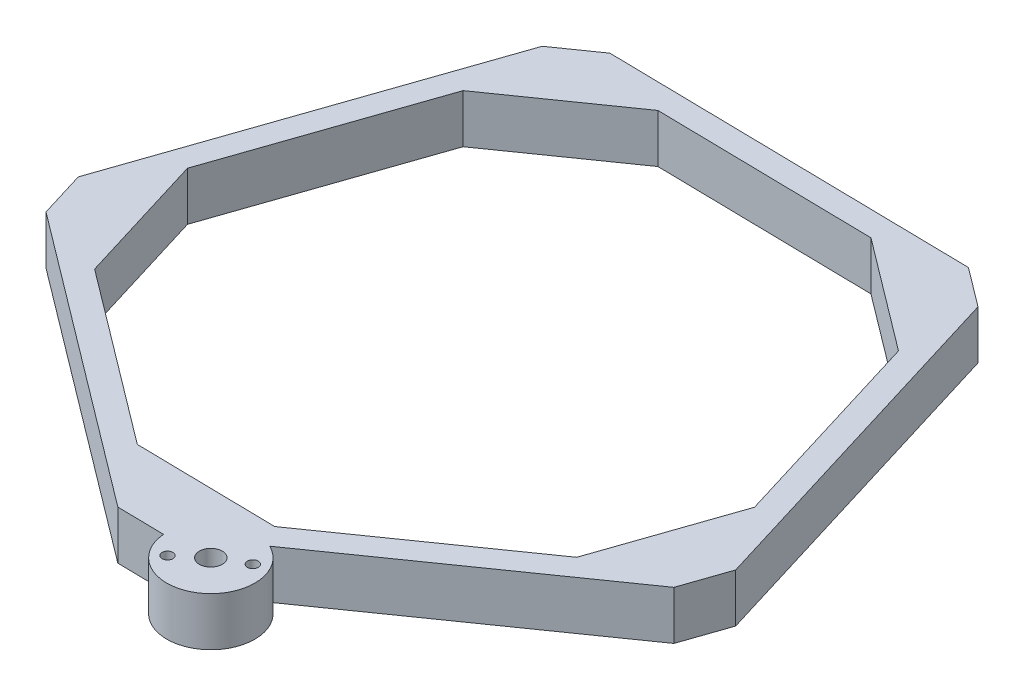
ISO-10303-21;
HEADER;
FILE_DESCRIPTION(('STEP AP214'),'2;1');
FILE_NAME('part.step','',(''),(''),'','','');
FILE_SCHEMA(('AUTOMOTIVE_DESIGN { 1 0 10303 214 1 1 1 1 }'));
ENDSEC;
DATA;
#1=APPLICATION_CONTEXT('core data for automotive mechanical design processes');
#2=APPLICATION_PROTOCOL_DEFINITION('international standard','automotive_design',2000,#1);
#3=PRODUCT_CONTEXT('',#1,'mechanical');
#4=PRODUCT('Part','Part','',(#3));
#5=PRODUCT_RELATED_PRODUCT_CATEGORY('part','',(#4));
#6=PRODUCT_DEFINITION_FORMATION('','',#4);
#7=PRODUCT_DEFINITION_CONTEXT('part definition',#1,'design');
#8=PRODUCT_DEFINITION('design','',#6,#7);
#9=PRODUCT_DEFINITION_SHAPE('','',#8);
#10=(LENGTH_UNIT() NAMED_UNIT(*) SI_UNIT(.MILLI.,.METRE.));
#11=(NAMED_UNIT(*) PLANE_ANGLE_UNIT() SI_UNIT($,.RADIAN.));
#12=(NAMED_UNIT(*) SI_UNIT($,.STERADIAN.) SOLID_ANGLE_UNIT());
#13=UNCERTAINTY_MEASURE_WITH_UNIT(LENGTH_MEASURE(1.E-05),#10,'distance_accuracy_value','');
#14=(GEOMETRIC_REPRESENTATION_CONTEXT(3) GLOBAL_UNCERTAINTY_ASSIGNED_CONTEXT((#13)) GLOBAL_UNIT_ASSIGNED_CONTEXT((#10,
#11,#12)) REPRESENTATION_CONTEXT('',''));
#15=CARTESIAN_POINT('',(0.,0.,0.));
#16=DIRECTION('',(0.,0.,1.));
#17=DIRECTION('',(1.,0.,0.));
#18=AXIS2_PLACEMENT_3D('',#15,#16,#17);
#19=CARTESIAN_POINT('',(0.,12.7,0.));
#20=DIRECTION('',(0.,-1.,0.));
#21=DIRECTION('',(0.,0.,-1.));
#22=AXIS2_PLACEMENT_3D('',#19,#20,#21);
#23=PLANE('',#22);
#24=DIRECTION('',(-0.325568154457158,0.,0.945518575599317));
#25=VECTOR('',#24,1.);
#26=CARTESIAN_POINT('',(-51.4065745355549,12.7,-65.9424590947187));
#27=LINE('',#26,#25);
#28=CARTESIAN_POINT('',(-57.0340931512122,12.7,-49.5989583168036));
#29=VERTEX_POINT('',#28);
#30=CARTESIAN_POINT('',(-75.4796465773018,12.7,3.97081858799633));
#31=VERTEX_POINT('',#30);
#32=EDGE_CURVE('E188',#29,#31,#27,.T.);
#33=ORIENTED_EDGE('',*,*,#32,.F.);
#34=DIRECTION('',(0.819152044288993,0.,-0.573576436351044));
#35=VECTOR('',#34,1.);
#36=CARTESIAN_POINT('',(-57.0340931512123,12.7,-49.5989583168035));
#37=LINE('',#36,#35);
#38=CARTESIAN_POINT('',(-27.1009664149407,12.7,-70.5583592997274));
#39=VERTEX_POINT('',#38);
#40=EDGE_CURVE('E206',#29,#39,#37,.T.);
#41=ORIENTED_EDGE('',*,*,#40,.T.);
#42=DIRECTION('',(-0.999847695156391,0.,-0.0174524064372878));
#43=VECTOR('',#42,1.);
#44=CARTESIAN_POINT('',(-44.3835582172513,12.7,-70.8600280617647));
#45=LINE('',#44,#43);
#46=CARTESIAN_POINT('',(29.5469084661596,12.7,-69.569566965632));
#47=VERTEX_POINT('',#46);
#48=EDGE_CURVE('E280',#47,#39,#45,.T.);
#49=ORIENTED_EDGE('',*,*,#48,.F.);
#50=DIRECTION('',(0.79863551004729,0.,0.601815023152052));
#51=VECTOR('',#50,1.);
#52=CARTESIAN_POINT('',(29.5469084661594,12.7,-69.5695669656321));
#53=LINE('',#52,#51);
#54=CARTESIAN_POINT('',(58.7303282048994,12.7,-47.5782828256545));
#55=VERTEX_POINT('',#54);
#56=EDGE_CURVE('E201',#47,#55,#53,.T.);
#57=ORIENTED_EDGE('',*,*,#56,.T.);
#58=DIRECTION('',(-0.292371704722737,0.,-0.956304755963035));
#59=VECTOR('',#58,1.);
#60=CARTESIAN_POINT('',(80.3487973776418,12.7,23.1325436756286));
#61=LINE('',#60,#59);
#62=CARTESIAN_POINT('',(75.2950868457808,12.7,6.60260134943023));
#63=VERTEX_POINT('',#62);
#64=EDGE_CURVE('E57',#63,#55,#61,.T.);
#65=ORIENTED_EDGE('',*,*,#64,.F.);
#66=DIRECTION('',(-0.325568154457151,0.,0.945518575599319));
#67=VECTOR('',#66,1.);
#68=CARTESIAN_POINT('',(75.2950868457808,12.7,6.60260134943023));
#69=LINE('',#68,#67);
#70=CARTESIAN_POINT('',(63.3983054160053,12.7,41.1533633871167));
#71=VERTEX_POINT('',#70);
#72=EDGE_CURVE('E235',#63,#71,#69,.T.);
#73=ORIENTED_EDGE('',*,*,#72,.T.);
#74=DIRECTION('',(0.819152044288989,0.,-0.57357643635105));
#75=VECTOR('',#74,1.);
#76=CARTESIAN_POINT('',(2.8287874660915,12.7,83.5645964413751));
#77=LINE('',#76,#75);
#78=CARTESIAN_POINT('',(16.9880143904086,12.7,73.6501990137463));
#79=VERTEX_POINT('',#78);
#80=EDGE_CURVE('E277',#79,#71,#77,.T.);
#81=ORIENTED_EDGE('',*,*,#80,.F.);
#82=DIRECTION('',(-0.999847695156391,0.,-0.0174524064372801));
#83=VECTOR('',#82,1.);
#84=CARTESIAN_POINT('',(16.9880143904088,12.7,73.6501990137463));
#85=LINE('',#84,#83);
#86=CARTESIAN_POINT('',(-19.548020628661,12.7,73.0124601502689));
#87=VERTEX_POINT('',#86);
#88=EDGE_CURVE('E224',#79,#87,#85,.T.);
#89=ORIENTED_EDGE('',*,*,#88,.T.);
#90=DIRECTION('',(0.798635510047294,0.,0.601815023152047));
#91=VECTOR('',#90,1.);
#92=CARTESIAN_POINT('',(-78.6005105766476,12.7,28.5132171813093));
#93=LINE('',#92,#91);
#94=CARTESIAN_POINT('',(-64.795916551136,12.7,38.9157249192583));
#95=VERTEX_POINT('',#94);
#96=EDGE_CURVE('E275',#95,#87,#93,.T.);
#97=ORIENTED_EDGE('',*,*,#96,.F.);
#98=DIRECTION('',(-0.292371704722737,0.,-0.956304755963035));
#99=VECTOR('',#98,1.);
#100=CARTESIAN_POINT('',(-64.7959165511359,12.7,38.9157249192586));
#101=LINE('',#100,#99);
#102=EDGE_CURVE('E213',#95,#31,#101,.T.);
#103=ORIENTED_EDGE('',*,*,#102,.T.);
#104=EDGE_LOOP('',(#33,#41,#49,#57,#65,#73,#81,#89,#97,#103));
#105=FACE_BOUND('',#104,.T.);
#106=CARTESIAN_POINT('',(9.55024996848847,12.7,94.2122741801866));
#107=DIRECTION('',(0.,1.,0.));
#108=DIRECTION('',(0.,0.,1.));
#109=AXIS2_PLACEMENT_3D('',#106,#107,#108);
#110=CIRCLE('',#109,1.4224);
#111=CARTESIAN_POINT('',(9.55024996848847,12.7,95.6346741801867));
#112=VERTEX_POINT('',#111);
#113=EDGE_CURVE('E246',#112,#112,#110,.T.);
#114=ORIENTED_EDGE('',*,*,#113,.F.);
#115=EDGE_LOOP('',(#114));
#116=FACE_BOUND('',#115,.T.);
#117=CARTESIAN_POINT('',(15.7019628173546,12.7,89.0502562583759));
#118=DIRECTION('',(0.,1.,0.));
#119=DIRECTION('',(0.,0.,1.));
#120=AXIS2_PLACEMENT_3D('',#117,#118,#119);
#121=CIRCLE('',#120,3.);
#122=CARTESIAN_POINT('',(15.7019628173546,12.7,92.0502562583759));
#123=VERTEX_POINT('',#122);
#124=EDGE_CURVE('E259',#123,#123,#121,.T.);
#125=ORIENTED_EDGE('',*,*,#124,.F.);
#126=EDGE_LOOP('',(#125));
#127=FACE_BOUND('',#126,.T.);
#128=DIRECTION('',(0.999847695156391,0.,0.01745240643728));
#129=VECTOR('',#128,1.);
#130=CARTESIAN_POINT('',(-7.91717521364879,12.7,89.7279922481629));
#131=LINE('',#130,#129);
#132=CARTESIAN_POINT('',(-7.91717521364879,12.7,89.7279922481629));
#133=VERTEX_POINT('',#132);
#134=CARTESIAN_POINT('',(4.23644421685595,12.7,89.9401344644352));
#135=VERTEX_POINT('',#134);
#136=EDGE_CURVE('E305',#133,#135,#131,.T.);
#137=ORIENTED_EDGE('',*,*,#136,.T.);
#138=CARTESIAN_POINT('',(15.7019628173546,12.7,89.0502562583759));
#139=DIRECTION('',(0.,1.,0.));
#140=DIRECTION('',(0.,0.,1.));
#141=AXIS2_PLACEMENT_3D('',#138,#139,#140);
#142=CIRCLE('',#141,11.5);
#143=CARTESIAN_POINT('',(20.7924058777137,12.7,78.7382540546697));
#144=VERTEX_POINT('',#143);
#145=EDGE_CURVE('E263',#135,#144,#142,.T.);
#146=ORIENTED_EDGE('',*,*,#145,.T.);
#147=DIRECTION('',(0.819152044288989,0.,-0.57357643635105));
#148=VECTOR('',#147,1.);
#149=CARTESIAN_POINT('',(4.78089051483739,12.7,89.9496378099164));
#150=LINE('',#149,#148);
#151=CARTESIAN_POINT('',(82.8898500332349,12.7,35.2571555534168));
#152=VERTEX_POINT('',#151);
#153=EDGE_CURVE('E308',#144,#152,#150,.T.);
#154=ORIENTED_EDGE('',*,*,#153,.T.);
#155=DIRECTION('',(0.325568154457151,0.,-0.945518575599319));
#156=VECTOR('',#155,1.);
#157=CARTESIAN_POINT('',(87.0245655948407,12.7,23.2490696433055));
#158=LINE('',#157,#156);
#159=CARTESIAN_POINT('',(87.0245655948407,12.7,23.2490696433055));
#160=VERTEX_POINT('',#159);
#161=EDGE_CURVE('E310',#152,#160,#158,.T.);
#162=ORIENTED_EDGE('',*,*,#161,.T.);
#163=DIRECTION('',(-0.292371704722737,0.,-0.956304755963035));
#164=VECTOR('',#163,1.);
#165=CARTESIAN_POINT('',(87.0245655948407,12.7,23.2490696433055));
#166=LINE('',#165,#164);
#167=CARTESIAN_POINT('',(59.1459198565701,12.7,-67.9378717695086));
#168=VERTEX_POINT('',#167);
#169=EDGE_CURVE('E289',#160,#168,#166,.T.);
#170=ORIENTED_EDGE('',*,*,#169,.T.);
#171=DIRECTION('',(-0.79863551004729,0.,-0.601815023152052));
#172=VECTOR('',#171,1.);
#173=CARTESIAN_POINT('',(49.0032488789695,12.7,-75.5809225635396));
#174=LINE('',#173,#172);
#175=CARTESIAN_POINT('',(49.0032488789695,12.7,-75.5809225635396));
#176=VERTEX_POINT('',#175);
#177=EDGE_CURVE('E292',#168,#176,#174,.T.);
#178=ORIENTED_EDGE('',*,*,#177,.T.);
#179=DIRECTION('',(-0.999847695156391,0.,-0.0174524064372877));
#180=VECTOR('',#179,1.);
#181=CARTESIAN_POINT('',(-46.3356612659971,12.7,-77.2450694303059));
#182=LINE('',#181,#180);
#183=CARTESIAN_POINT('',(-46.3356612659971,12.7,-77.2450694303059));
#184=VERTEX_POINT('',#183);
#185=EDGE_CURVE('E295',#176,#184,#182,.T.);
#186=ORIENTED_EDGE('',*,*,#185,.T.);
#187=DIRECTION('',(-0.819152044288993,0.,0.573576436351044));
#188=VECTOR('',#187,1.);
#189=CARTESIAN_POINT('',(-56.7388922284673,12.7,-69.9606486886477));
#190=LINE('',#189,#188);
#191=CARTESIAN_POINT('',(-56.7388922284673,12.7,-69.9606486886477));
#192=VERTEX_POINT('',#191);
#193=EDGE_CURVE('E297',#184,#192,#190,.T.);
#194=ORIENTED_EDGE('',*,*,#193,.T.);
#195=DIRECTION('',(-0.325568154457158,0.,0.945518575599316));
#196=VECTOR('',#195,1.);
#197=CARTESIAN_POINT('',(-56.7388922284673,12.7,-69.9606486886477));
#198=LINE('',#197,#196);
#199=CARTESIAN_POINT('',(-87.782933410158,12.7,20.1977933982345));
#200=VERTEX_POINT('',#199);
#201=EDGE_CURVE('E299',#192,#200,#198,.T.);
#202=ORIENTED_EDGE('',*,*,#201,.T.);
#203=DIRECTION('',(0.292371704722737,0.,0.956304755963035));
#204=VECTOR('',#203,1.);
#205=CARTESIAN_POINT('',(-87.782933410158,12.7,20.1977933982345));
#206=LINE('',#205,#204);
#207=CARTESIAN_POINT('',(-84.0698127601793,12.7,32.342863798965));
#208=VERTEX_POINT('',#207);
#209=EDGE_CURVE('E301',#200,#208,#206,.T.);
#210=ORIENTED_EDGE('',*,*,#209,.T.);
#211=DIRECTION('',(0.798635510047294,0.,0.601815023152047));
#212=VECTOR('',#211,1.);
#213=CARTESIAN_POINT('',(-84.0698127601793,12.7,32.342863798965));
#214=LINE('',#213,#212);
#215=EDGE_CURVE('E303',#208,#133,#214,.T.);
#216=ORIENTED_EDGE('',*,*,#215,.T.);
#217=EDGE_LOOP('',(#137,#146,#154,#162,#170,#178,#186,#194,#202,#210,#216));
#218=FACE_BOUND('',#217,.T.);
#219=CARTESIAN_POINT('',(22.6566826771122,12.7,85.0350511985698));
#220=DIRECTION('',(0.,1.,0.));
#221=DIRECTION('',(0.,0.,1.));
#222=AXIS2_PLACEMENT_3D('',#219,#220,#221);
#223=CIRCLE('',#222,1.4224);
#224=CARTESIAN_POINT('',(22.6566826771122,12.7,86.4574511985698));
#225=VERTEX_POINT('',#224);
#226=EDGE_CURVE('E253',#225,#225,#223,.T.);
#227=ORIENTED_EDGE('',*,*,#226,.F.);
#228=EDGE_LOOP('',(#227));
#229=FACE_BOUND('',#228,.T.);
#230=ADVANCED_FACE('F37',(#105,#116,#127,#218,#229),#23,.F.);
#231=CARTESIAN_POINT('',(0.,0.,0.));
#232=DIRECTION('',(0.,-1.,0.));
#233=DIRECTION('',(0.,0.,-1.));
#234=AXIS2_PLACEMENT_3D('',#231,#232,#233);
#235=PLANE('',#234);
#236=DIRECTION('',(0.819152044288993,0.,-0.573576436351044));
#237=VECTOR('',#236,1.);
#238=CARTESIAN_POINT('',(-57.0340931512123,0.,-49.5989583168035));
#239=LINE('',#238,#237);
#240=CARTESIAN_POINT('',(-57.0340931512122,0.,-49.5989583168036));
#241=VERTEX_POINT('',#240);
#242=CARTESIAN_POINT('',(-27.1009664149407,0.,-70.5583592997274));
#243=VERTEX_POINT('',#242);
#244=EDGE_CURVE('E210',#241,#243,#239,.T.);
#245=ORIENTED_EDGE('',*,*,#244,.F.);
#246=DIRECTION('',(-0.325568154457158,0.,0.945518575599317));
#247=VECTOR('',#246,1.);
#248=CARTESIAN_POINT('',(-51.4065745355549,0.,-65.9424590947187));
#249=LINE('',#248,#247);
#250=CARTESIAN_POINT('',(-75.4796465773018,0.,3.97081858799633));
#251=VERTEX_POINT('',#250);
#252=EDGE_CURVE('E273',#241,#251,#249,.T.);
#253=ORIENTED_EDGE('',*,*,#252,.T.);
#254=DIRECTION('',(-0.292371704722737,0.,-0.956304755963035));
#255=VECTOR('',#254,1.);
#256=CARTESIAN_POINT('',(-64.7959165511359,0.,38.9157249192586));
#257=LINE('',#256,#255);
#258=CARTESIAN_POINT('',(-64.7959165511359,0.,38.9157249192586));
#259=VERTEX_POINT('',#258);
#260=EDGE_CURVE('E218',#259,#251,#257,.T.);
#261=ORIENTED_EDGE('',*,*,#260,.F.);
#262=DIRECTION('',(0.798635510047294,0.,0.601815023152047));
#263=VECTOR('',#262,1.);
#264=CARTESIAN_POINT('',(-78.6005105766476,0.,28.5132171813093));
#265=LINE('',#264,#263);
#266=CARTESIAN_POINT('',(-19.548020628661,0.,73.0124601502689));
#267=VERTEX_POINT('',#266);
#268=EDGE_CURVE('E284',#259,#267,#265,.T.);
#269=ORIENTED_EDGE('',*,*,#268,.T.);
#270=DIRECTION('',(-0.999847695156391,0.,-0.0174524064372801));
#271=VECTOR('',#270,1.);
#272=CARTESIAN_POINT('',(16.9880143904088,0.,73.6501990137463));
#273=LINE('',#272,#271);
#274=CARTESIAN_POINT('',(16.9880143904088,0.,73.6501990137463));
#275=VERTEX_POINT('',#274);
#276=EDGE_CURVE('E229',#275,#267,#273,.T.);
#277=ORIENTED_EDGE('',*,*,#276,.F.);
#278=DIRECTION('',(0.819152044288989,0.,-0.57357643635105));
#279=VECTOR('',#278,1.);
#280=CARTESIAN_POINT('',(2.8287874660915,0.,83.5645964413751));
#281=LINE('',#280,#279);
#282=CARTESIAN_POINT('',(63.3983054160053,0.,41.1533633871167));
#283=VERTEX_POINT('',#282);
#284=EDGE_CURVE('E286',#275,#283,#281,.T.);
#285=ORIENTED_EDGE('',*,*,#284,.T.);
#286=DIRECTION('',(-0.325568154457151,0.,0.945518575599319));
#287=VECTOR('',#286,1.);
#288=CARTESIAN_POINT('',(75.2950868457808,0.,6.60260134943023));
#289=LINE('',#288,#287);
#290=CARTESIAN_POINT('',(75.2950868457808,0.,6.60260134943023));
#291=VERTEX_POINT('',#290);
#292=EDGE_CURVE('E240',#291,#283,#289,.T.);
#293=ORIENTED_EDGE('',*,*,#292,.F.);
#294=DIRECTION('',(-0.292371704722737,0.,-0.956304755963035));
#295=VECTOR('',#294,1.);
#296=CARTESIAN_POINT('',(80.3487973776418,0.,23.1325436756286));
#297=LINE('',#296,#295);
#298=CARTESIAN_POINT('',(58.7303282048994,0.,-47.5782828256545));
#299=VERTEX_POINT('',#298);
#300=EDGE_CURVE('E189',#291,#299,#297,.T.);
#301=ORIENTED_EDGE('',*,*,#300,.T.);
#302=DIRECTION('',(0.79863551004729,0.,0.601815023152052));
#303=VECTOR('',#302,1.);
#304=CARTESIAN_POINT('',(29.5469084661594,0.,-69.5695669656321));
#305=LINE('',#304,#303);
#306=CARTESIAN_POINT('',(29.5469084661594,0.,-69.5695669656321));
#307=VERTEX_POINT('',#306);
#308=EDGE_CURVE('E192',#307,#299,#305,.T.);
#309=ORIENTED_EDGE('',*,*,#308,.F.);
#310=DIRECTION('',(-0.999847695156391,0.,-0.0174524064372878));
#311=VECTOR('',#310,1.);
#312=CARTESIAN_POINT('',(-44.3835582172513,0.,-70.8600280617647));
#313=LINE('',#312,#311);
#314=EDGE_CURVE('E177',#307,#243,#313,.T.);
#315=ORIENTED_EDGE('',*,*,#314,.T.);
#316=EDGE_LOOP('',(#245,#253,#261,#269,#277,#285,#293,#301,#309,#315));
#317=FACE_BOUND('',#316,.T.);
#318=CARTESIAN_POINT('',(9.55024996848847,0.,94.2122741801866));
#319=DIRECTION('',(0.,1.,0.));
#320=DIRECTION('',(0.,0.,1.));
#321=AXIS2_PLACEMENT_3D('',#318,#319,#320);
#322=CIRCLE('',#321,1.4224);
#323=CARTESIAN_POINT('',(9.55024996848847,0.,95.6346741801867));
#324=VERTEX_POINT('',#323);
#325=EDGE_CURVE('E250',#324,#324,#322,.T.);
#326=ORIENTED_EDGE('',*,*,#325,.T.);
#327=EDGE_LOOP('',(#326));
#328=FACE_BOUND('',#327,.T.);
#329=DIRECTION('',(0.819152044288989,0.,-0.57357643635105));
#330=VECTOR('',#329,1.);
#331=CARTESIAN_POINT('',(4.78089051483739,0.,89.9496378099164));
#332=LINE('',#331,#330);
#333=CARTESIAN_POINT('',(20.7924058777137,0.,78.7382540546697));
#334=VERTEX_POINT('',#333);
#335=CARTESIAN_POINT('',(82.8898500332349,0.,35.2571555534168));
#336=VERTEX_POINT('',#335);
#337=EDGE_CURVE('E330',#334,#336,#332,.T.);
#338=ORIENTED_EDGE('',*,*,#337,.F.);
#339=CARTESIAN_POINT('',(15.7019628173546,0.,89.0502562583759));
#340=DIRECTION('',(0.,-1.,0.));
#341=DIRECTION('',(0.,0.,-1.));
#342=AXIS2_PLACEMENT_3D('',#339,#340,#341);
#343=CIRCLE('',#342,11.5);
#344=CARTESIAN_POINT('',(4.23644421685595,0.,89.9401344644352));
#345=VERTEX_POINT('',#344);
#346=EDGE_CURVE('E268',#345,#334,#343,.F.);
#347=ORIENTED_EDGE('',*,*,#346,.F.);
#348=DIRECTION('',(0.999847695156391,0.,0.01745240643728));
#349=VECTOR('',#348,1.);
#350=CARTESIAN_POINT('',(-7.91717521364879,0.,89.7279922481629));
#351=LINE('',#350,#349);
#352=CARTESIAN_POINT('',(-7.91717521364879,0.,89.7279922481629));
#353=VERTEX_POINT('',#352);
#354=EDGE_CURVE('E327',#353,#345,#351,.T.);
#355=ORIENTED_EDGE('',*,*,#354,.F.);
#356=DIRECTION('',(0.798635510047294,0.,0.601815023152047));
#357=VECTOR('',#356,1.);
#358=CARTESIAN_POINT('',(-84.0698127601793,0.,32.342863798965));
#359=LINE('',#358,#357);
#360=CARTESIAN_POINT('',(-84.0698127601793,0.,32.342863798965));
#361=VERTEX_POINT('',#360);
#362=EDGE_CURVE('E325',#361,#353,#359,.T.);
#363=ORIENTED_EDGE('',*,*,#362,.F.);
#364=DIRECTION('',(0.292371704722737,0.,0.956304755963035));
#365=VECTOR('',#364,1.);
#366=CARTESIAN_POINT('',(-87.782933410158,0.,20.1977933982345));
#367=LINE('',#366,#365);
#368=CARTESIAN_POINT('',(-87.782933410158,0.,20.1977933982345));
#369=VERTEX_POINT('',#368);
#370=EDGE_CURVE('E323',#369,#361,#367,.T.);
#371=ORIENTED_EDGE('',*,*,#370,.F.);
#372=DIRECTION('',(-0.325568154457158,0.,0.945518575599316));
#373=VECTOR('',#372,1.);
#374=CARTESIAN_POINT('',(-56.7388922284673,0.,-69.9606486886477));
#375=LINE('',#374,#373);
#376=CARTESIAN_POINT('',(-56.7388922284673,0.,-69.9606486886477));
#377=VERTEX_POINT('',#376);
#378=EDGE_CURVE('E321',#377,#369,#375,.T.);
#379=ORIENTED_EDGE('',*,*,#378,.F.);
#380=DIRECTION('',(-0.819152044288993,0.,0.573576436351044));
#381=VECTOR('',#380,1.);
#382=CARTESIAN_POINT('',(-56.7388922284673,0.,-69.9606486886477));
#383=LINE('',#382,#381);
#384=CARTESIAN_POINT('',(-46.3356612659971,0.,-77.2450694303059));
#385=VERTEX_POINT('',#384);
#386=EDGE_CURVE('E319',#385,#377,#383,.T.);
#387=ORIENTED_EDGE('',*,*,#386,.F.);
#388=DIRECTION('',(-0.999847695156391,0.,-0.0174524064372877));
#389=VECTOR('',#388,1.);
#390=CARTESIAN_POINT('',(-46.3356612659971,0.,-77.2450694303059));
#391=LINE('',#390,#389);
#392=CARTESIAN_POINT('',(49.0032488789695,0.,-75.5809225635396));
#393=VERTEX_POINT('',#392);
#394=EDGE_CURVE('E317',#393,#385,#391,.T.);
#395=ORIENTED_EDGE('',*,*,#394,.F.);
#396=DIRECTION('',(-0.79863551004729,0.,-0.601815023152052));
#397=VECTOR('',#396,1.);
#398=CARTESIAN_POINT('',(49.0032488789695,0.,-75.5809225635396));
#399=LINE('',#398,#397);
#400=CARTESIAN_POINT('',(59.1459198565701,0.,-67.9378717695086));
#401=VERTEX_POINT('',#400);
#402=EDGE_CURVE('E315',#401,#393,#399,.T.);
#403=ORIENTED_EDGE('',*,*,#402,.F.);
#404=DIRECTION('',(-0.292371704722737,0.,-0.956304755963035));
#405=VECTOR('',#404,1.);
#406=CARTESIAN_POINT('',(87.0245655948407,0.,23.2490696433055));
#407=LINE('',#406,#405);
#408=CARTESIAN_POINT('',(87.0245655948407,0.,23.2490696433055));
#409=VERTEX_POINT('',#408);
#410=EDGE_CURVE('E282',#409,#401,#407,.T.);
#411=ORIENTED_EDGE('',*,*,#410,.F.);
#412=DIRECTION('',(0.325568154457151,0.,-0.945518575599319));
#413=VECTOR('',#412,1.);
#414=CARTESIAN_POINT('',(87.0245655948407,0.,23.2490696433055));
#415=LINE('',#414,#413);
#416=EDGE_CURVE('E293',#336,#409,#415,.T.);
#417=ORIENTED_EDGE('',*,*,#416,.F.);
#418=EDGE_LOOP('',(#338,#347,#355,#363,#371,#379,#387,#395,#403,#411,#417));
#419=FACE_BOUND('',#418,.T.);
#420=CARTESIAN_POINT('',(15.7019628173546,0.,89.0502562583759));
#421=DIRECTION('',(0.,1.,0.));
#422=DIRECTION('',(0.,0.,1.));
#423=AXIS2_PLACEMENT_3D('',#420,#421,#422);
#424=CIRCLE('',#423,3.);
#425=CARTESIAN_POINT('',(15.7019628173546,0.,92.0502562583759));
#426=VERTEX_POINT('',#425);
#427=EDGE_CURVE('E260',#426,#426,#424,.T.);
#428=ORIENTED_EDGE('',*,*,#427,.T.);
#429=EDGE_LOOP('',(#428));
#430=FACE_BOUND('',#429,.T.);
#431=CARTESIAN_POINT('',(22.6566826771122,0.,85.0350511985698));
#432=DIRECTION('',(0.,1.,0.));
#433=DIRECTION('',(0.,0.,1.));
#434=AXIS2_PLACEMENT_3D('',#431,#432,#433);
#435=CIRCLE('',#434,1.4224);
#436=CARTESIAN_POINT('',(22.6566826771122,0.,86.4574511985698));
#437=VERTEX_POINT('',#436);
#438=EDGE_CURVE('E256',#437,#437,#435,.T.);
#439=ORIENTED_EDGE('',*,*,#438,.T.);
#440=EDGE_LOOP('',(#439));
#441=FACE_BOUND('',#440,.T.);
#442=ADVANCED_FACE('F193',(#317,#328,#419,#430,#441),#235,.T.);
#443=CARTESIAN_POINT('',(87.0245655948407,12.7,23.2490696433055));
#444=DIRECTION('',(-0.956304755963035,0.,0.292371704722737));
#445=DIRECTION('',(0.292371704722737,0.,0.956304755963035));
#446=AXIS2_PLACEMENT_3D('',#443,#444,#445);
#447=PLANE('',#446);
#448=ORIENTED_EDGE('',*,*,#410,.T.);
#449=DIRECTION('',(0.,-1.,0.));
#450=VECTOR('',#449,1.);
#451=CARTESIAN_POINT('',(59.1459198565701,12.7,-67.9378717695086));
#452=LINE('',#451,#450);
#453=EDGE_CURVE('E45',#168,#401,#452,.T.);
#454=ORIENTED_EDGE('',*,*,#453,.F.);
#455=ORIENTED_EDGE('',*,*,#169,.F.);
#456=DIRECTION('',(0.,-1.,0.));
#457=VECTOR('',#456,1.);
#458=CARTESIAN_POINT('',(87.0245655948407,12.7,23.2490696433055));
#459=LINE('',#458,#457);
#460=EDGE_CURVE('E312',#160,#409,#459,.T.);
#461=ORIENTED_EDGE('',*,*,#460,.T.);
#462=EDGE_LOOP('',(#448,#454,#455,#461));
#463=FACE_BOUND('',#462,.T.);
#464=ADVANCED_FACE('F39',(#463),#447,.F.);
#465=CARTESIAN_POINT('',(49.0032488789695,12.7,-75.5809225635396));
#466=DIRECTION('',(-0.601815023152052,0.,0.79863551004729));
#467=DIRECTION('',(0.79863551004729,0.,0.601815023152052));
#468=AXIS2_PLACEMENT_3D('',#465,#466,#467);
#469=PLANE('',#468);
#470=ORIENTED_EDGE('',*,*,#402,.T.);
#471=DIRECTION('',(0.,-1.,0.));
#472=VECTOR('',#471,1.);
#473=CARTESIAN_POINT('',(49.0032488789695,12.7,-75.5809225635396));
#474=LINE('',#473,#472);
#475=EDGE_CURVE('E353',#176,#393,#474,.T.);
#476=ORIENTED_EDGE('',*,*,#475,.F.);
#477=ORIENTED_EDGE('',*,*,#177,.F.);
#478=ORIENTED_EDGE('',*,*,#453,.T.);
#479=EDGE_LOOP('',(#470,#476,#477,#478));
#480=FACE_BOUND('',#479,.T.);
#481=ADVANCED_FACE('F358',(#480),#469,.F.);
#482=CARTESIAN_POINT('',(-46.3356612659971,12.7,-77.2450694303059));
#483=DIRECTION('',(-0.0174524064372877,0.,0.999847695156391));
#484=DIRECTION('',(0.999847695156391,0.,0.0174524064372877));
#485=AXIS2_PLACEMENT_3D('',#482,#483,#484);
#486=PLANE('',#485);
#487=ORIENTED_EDGE('',*,*,#394,.T.);
#488=DIRECTION('',(0.,-1.,0.));
#489=VECTOR('',#488,1.);
#490=CARTESIAN_POINT('',(-46.3356612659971,12.7,-77.2450694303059));
#491=LINE('',#490,#489);
#492=EDGE_CURVE('E350',#184,#385,#491,.T.);
#493=ORIENTED_EDGE('',*,*,#492,.F.);
#494=ORIENTED_EDGE('',*,*,#185,.F.);
#495=ORIENTED_EDGE('',*,*,#475,.T.);
#496=EDGE_LOOP('',(#487,#493,#494,#495));
#497=FACE_BOUND('',#496,.T.);
#498=ADVANCED_FACE('F373',(#497),#486,.F.);
#499=CARTESIAN_POINT('',(-56.7388922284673,12.7,-69.9606486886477));
#500=DIRECTION('',(0.573576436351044,0.,0.819152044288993));
#501=DIRECTION('',(0.819152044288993,0.,-0.573576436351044));
#502=AXIS2_PLACEMENT_3D('',#499,#500,#501);
#503=PLANE('',#502);
#504=ORIENTED_EDGE('',*,*,#386,.T.);
#505=DIRECTION('',(0.,-1.,0.));
#506=VECTOR('',#505,1.);
#507=CARTESIAN_POINT('',(-56.7388922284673,12.7,-69.9606486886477));
#508=LINE('',#507,#506);
#509=EDGE_CURVE('E347',#192,#377,#508,.T.);
#510=ORIENTED_EDGE('',*,*,#509,.F.);
#511=ORIENTED_EDGE('',*,*,#193,.F.);
#512=ORIENTED_EDGE('',*,*,#492,.T.);
#513=EDGE_LOOP('',(#504,#510,#511,#512));
#514=FACE_BOUND('',#513,.T.);
#515=ADVANCED_FACE('F377',(#514),#503,.F.);
#516=CARTESIAN_POINT('',(-56.7388922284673,12.7,-69.9606486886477));
#517=DIRECTION('',(0.945518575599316,0.,0.325568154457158));
#518=DIRECTION('',(0.325568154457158,0.,-0.945518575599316));
#519=AXIS2_PLACEMENT_3D('',#516,#517,#518);
#520=PLANE('',#519);
#521=ORIENTED_EDGE('',*,*,#378,.T.);
#522=DIRECTION('',(0.,-1.,0.));
#523=VECTOR('',#522,1.);
#524=CARTESIAN_POINT('',(-87.782933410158,12.7,20.1977933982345));
#525=LINE('',#524,#523);
#526=EDGE_CURVE('E344',#200,#369,#525,.T.);
#527=ORIENTED_EDGE('',*,*,#526,.F.);
#528=ORIENTED_EDGE('',*,*,#201,.F.);
#529=ORIENTED_EDGE('',*,*,#509,.T.);
#530=EDGE_LOOP('',(#521,#527,#528,#529));
#531=FACE_BOUND('',#530,.T.);
#532=ADVANCED_FACE('F407',(#531),#520,.F.);
#533=CARTESIAN_POINT('',(-87.782933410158,12.7,20.1977933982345));
#534=DIRECTION('',(0.956304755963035,0.,-0.292371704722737));
#535=DIRECTION('',(-0.292371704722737,0.,-0.956304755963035));
#536=AXIS2_PLACEMENT_3D('',#533,#534,#535);
#537=PLANE('',#536);
#538=ORIENTED_EDGE('',*,*,#370,.T.);
#539=DIRECTION('',(0.,-1.,0.));
#540=VECTOR('',#539,1.);
#541=CARTESIAN_POINT('',(-84.0698127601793,12.7,32.342863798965));
#542=LINE('',#541,#540);
#543=EDGE_CURVE('E341',#208,#361,#542,.T.);
#544=ORIENTED_EDGE('',*,*,#543,.F.);
#545=ORIENTED_EDGE('',*,*,#209,.F.);
#546=ORIENTED_EDGE('',*,*,#526,.T.);
#547=EDGE_LOOP('',(#538,#544,#545,#546));
#548=FACE_BOUND('',#547,.T.);
#549=ADVANCED_FACE('F404',(#548),#537,.F.);
#550=CARTESIAN_POINT('',(-84.0698127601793,12.7,32.342863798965));
#551=DIRECTION('',(0.601815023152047,0.,-0.798635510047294));
#552=DIRECTION('',(-0.798635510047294,0.,-0.601815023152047));
#553=AXIS2_PLACEMENT_3D('',#550,#551,#552);
#554=PLANE('',#553);
#555=ORIENTED_EDGE('',*,*,#362,.T.);
#556=DIRECTION('',(0.,-1.,0.));
#557=VECTOR('',#556,1.);
#558=CARTESIAN_POINT('',(-7.91717521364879,12.7,89.7279922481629));
#559=LINE('',#558,#557);
#560=EDGE_CURVE('E338',#133,#353,#559,.T.);
#561=ORIENTED_EDGE('',*,*,#560,.F.);
#562=ORIENTED_EDGE('',*,*,#215,.F.);
#563=ORIENTED_EDGE('',*,*,#543,.T.);
#564=EDGE_LOOP('',(#555,#561,#562,#563));
#565=FACE_BOUND('',#564,.T.);
#566=ADVANCED_FACE('F400',(#565),#554,.F.);
#567=CARTESIAN_POINT('',(-7.91717521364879,12.7,89.7279922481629));
#568=DIRECTION('',(0.01745240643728,0.,-0.999847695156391));
#569=DIRECTION('',(-0.999847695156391,0.,-0.01745240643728));
#570=AXIS2_PLACEMENT_3D('',#567,#568,#569);
#571=PLANE('',#570);
#572=ORIENTED_EDGE('',*,*,#354,.T.);
#573=DIRECTION('',(0.,1.,0.));
#574=VECTOR('',#573,1.);
#575=CARTESIAN_POINT('',(4.23644421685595,-32.5269119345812,89.9401344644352));
#576=LINE('',#575,#574);
#577=EDGE_CURVE('E270',#345,#135,#576,.T.);
#578=ORIENTED_EDGE('',*,*,#577,.T.);
#579=ORIENTED_EDGE('',*,*,#136,.F.);
#580=ORIENTED_EDGE('',*,*,#560,.T.);
#581=EDGE_LOOP('',(#572,#578,#579,#580));
#582=FACE_BOUND('',#581,.T.);
#583=ADVANCED_FACE('F395',(#582),#571,.F.);
#584=CARTESIAN_POINT('',(4.78089051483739,12.7,89.9496378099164));
#585=DIRECTION('',(-0.57357643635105,0.,-0.819152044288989));
#586=DIRECTION('',(-0.819152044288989,0.,0.57357643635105));
#587=AXIS2_PLACEMENT_3D('',#584,#585,#586);
#588=PLANE('',#587);
#589=ORIENTED_EDGE('',*,*,#153,.F.);
#590=DIRECTION('',(0.,1.,0.));
#591=VECTOR('',#590,1.);
#592=CARTESIAN_POINT('',(20.7924058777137,-32.5269119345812,78.7382540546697));
#593=LINE('',#592,#591);
#594=EDGE_CURVE('E11',#144,#334,#593,.F.);
#595=ORIENTED_EDGE('',*,*,#594,.T.);
#596=ORIENTED_EDGE('',*,*,#337,.T.);
#597=DIRECTION('',(0.,-1.,0.));
#598=VECTOR('',#597,1.);
#599=CARTESIAN_POINT('',(82.8898500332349,12.7,35.2571555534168));
#600=LINE('',#599,#598);
#601=EDGE_CURVE('E335',#152,#336,#600,.T.);
#602=ORIENTED_EDGE('',*,*,#601,.F.);
#603=EDGE_LOOP('',(#589,#595,#596,#602));
#604=FACE_BOUND('',#603,.T.);
#605=ADVANCED_FACE('F389',(#604),#588,.F.);
#606=CARTESIAN_POINT('',(87.0245655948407,12.7,23.2490696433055));
#607=DIRECTION('',(-0.945518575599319,0.,-0.325568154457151));
#608=DIRECTION('',(-0.325568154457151,0.,0.945518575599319));
#609=AXIS2_PLACEMENT_3D('',#606,#607,#608);
#610=PLANE('',#609);
#611=ORIENTED_EDGE('',*,*,#416,.T.);
#612=ORIENTED_EDGE('',*,*,#460,.F.);
#613=ORIENTED_EDGE('',*,*,#161,.F.);
#614=ORIENTED_EDGE('',*,*,#601,.T.);
#615=EDGE_LOOP('',(#611,#612,#613,#614));
#616=FACE_BOUND('',#615,.T.);
#617=ADVANCED_FACE('F387',(#616),#610,.F.);
#618=CARTESIAN_POINT('',(-51.4065745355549,12.7,-65.9424590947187));
#619=DIRECTION('',(0.945518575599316,0.,0.325568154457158));
#620=DIRECTION('',(0.325568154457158,0.,-0.945518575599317));
#621=AXIS2_PLACEMENT_3D('',#618,#619,#620);
#622=PLANE('',#621);
#623=DIRECTION('',(0.,1.,0.));
#624=VECTOR('',#623,1.);
#625=CARTESIAN_POINT('',(-57.0340931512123,-36.7154621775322,-49.5989583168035));
#626=LINE('',#625,#624);
#627=EDGE_CURVE('E209',#241,#29,#626,.T.);
#628=ORIENTED_EDGE('',*,*,#627,.T.);
#629=ORIENTED_EDGE('',*,*,#32,.T.);
#630=DIRECTION('',(0.,1.,0.));
#631=VECTOR('',#630,1.);
#632=CARTESIAN_POINT('',(-75.4796465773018,-38.5642750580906,3.97081858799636));
#633=LINE('',#632,#631);
#634=EDGE_CURVE('E221',#251,#31,#633,.T.);
#635=ORIENTED_EDGE('',*,*,#634,.F.);
#636=ORIENTED_EDGE('',*,*,#252,.F.);
#637=EDGE_LOOP('',(#628,#629,#635,#636));
#638=FACE_BOUND('',#637,.T.);
#639=ADVANCED_FACE('F426',(#638),#622,.T.);
#640=CARTESIAN_POINT('',(-78.6005105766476,12.7,28.5132171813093));
#641=DIRECTION('',(0.601815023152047,0.,-0.798635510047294));
#642=DIRECTION('',(-0.798635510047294,0.,-0.601815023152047));
#643=AXIS2_PLACEMENT_3D('',#640,#641,#642);
#644=PLANE('',#643);
#645=DIRECTION('',(0.,1.,0.));
#646=VECTOR('',#645,1.);
#647=CARTESIAN_POINT('',(-64.7959165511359,-38.5642750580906,38.9157249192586));
#648=LINE('',#647,#646);
#649=EDGE_CURVE('E217',#259,#95,#648,.T.);
#650=ORIENTED_EDGE('',*,*,#649,.T.);
#651=ORIENTED_EDGE('',*,*,#96,.T.);
#652=DIRECTION('',(0.,1.,0.));
#653=VECTOR('',#652,1.);
#654=CARTESIAN_POINT('',(-19.548020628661,-38.0293233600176,73.012460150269));
#655=LINE('',#654,#653);
#656=EDGE_CURVE('E232',#267,#87,#655,.T.);
#657=ORIENTED_EDGE('',*,*,#656,.F.);
#658=ORIENTED_EDGE('',*,*,#268,.F.);
#659=EDGE_LOOP('',(#650,#651,#657,#658));
#660=FACE_BOUND('',#659,.T.);
#661=ADVANCED_FACE('F459',(#660),#644,.T.);
#662=CARTESIAN_POINT('',(2.8287874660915,12.7,83.5645964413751));
#663=DIRECTION('',(-0.57357643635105,0.,-0.819152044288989));
#664=DIRECTION('',(-0.819152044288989,0.,0.57357643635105));
#665=AXIS2_PLACEMENT_3D('',#662,#663,#664);
#666=PLANE('',#665);
#667=DIRECTION('',(0.,1.,0.));
#668=VECTOR('',#667,1.);
#669=CARTESIAN_POINT('',(16.9880143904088,-38.0293233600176,73.6501990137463));
#670=LINE('',#669,#668);
#671=EDGE_CURVE('E228',#275,#79,#670,.T.);
#672=ORIENTED_EDGE('',*,*,#671,.T.);
#673=ORIENTED_EDGE('',*,*,#80,.T.);
#674=DIRECTION('',(0.,1.,0.));
#675=VECTOR('',#674,1.);
#676=CARTESIAN_POINT('',(63.3983054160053,-38.4847285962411,41.1533633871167));
#677=LINE('',#676,#675);
#678=EDGE_CURVE('E243',#283,#71,#677,.T.);
#679=ORIENTED_EDGE('',*,*,#678,.F.);
#680=ORIENTED_EDGE('',*,*,#284,.F.);
#681=EDGE_LOOP('',(#672,#673,#679,#680));
#682=FACE_BOUND('',#681,.T.);
#683=ADVANCED_FACE('F467',(#682),#666,.T.);
#684=CARTESIAN_POINT('',(80.3487973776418,12.7,23.1325436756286));
#685=DIRECTION('',(-0.956304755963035,0.,0.292371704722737));
#686=DIRECTION('',(0.292371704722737,0.,0.956304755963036));
#687=AXIS2_PLACEMENT_3D('',#684,#685,#686);
#688=PLANE('',#687);
#689=DIRECTION('',(0.,1.,0.));
#690=VECTOR('',#689,1.);
#691=CARTESIAN_POINT('',(58.7303282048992,-36.5416004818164,-47.5782828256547));
#692=LINE('',#691,#690);
#693=EDGE_CURVE('E52',#299,#55,#692,.T.);
#694=ORIENTED_EDGE('',*,*,#693,.F.);
#695=ORIENTED_EDGE('',*,*,#300,.F.);
#696=DIRECTION('',(0.,1.,0.));
#697=VECTOR('',#696,1.);
#698=CARTESIAN_POINT('',(75.2950868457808,-38.4847285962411,6.60260134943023));
#699=LINE('',#698,#697);
#700=EDGE_CURVE('E239',#291,#63,#699,.T.);
#701=ORIENTED_EDGE('',*,*,#700,.T.);
#702=ORIENTED_EDGE('',*,*,#64,.T.);
#703=EDGE_LOOP('',(#694,#695,#701,#702));
#704=FACE_BOUND('',#703,.T.);
#705=ADVANCED_FACE('F474',(#704),#688,.T.);
#706=CARTESIAN_POINT('',(-44.3835582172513,12.7,-70.8600280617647));
#707=DIRECTION('',(-0.0174524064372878,0.,0.999847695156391));
#708=DIRECTION('',(0.999847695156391,0.,0.0174524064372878));
#709=AXIS2_PLACEMENT_3D('',#706,#707,#708);
#710=PLANE('',#709);
#711=DIRECTION('',(0.,1.,0.));
#712=VECTOR('',#711,1.);
#713=CARTESIAN_POINT('',(29.5469084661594,-36.5416004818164,-69.5695669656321));
#714=LINE('',#713,#712);
#715=EDGE_CURVE('E181',#307,#47,#714,.T.);
#716=ORIENTED_EDGE('',*,*,#715,.T.);
#717=ORIENTED_EDGE('',*,*,#48,.T.);
#718=DIRECTION('',(0.,1.,0.));
#719=VECTOR('',#718,1.);
#720=CARTESIAN_POINT('',(-27.1009664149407,-36.7154621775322,-70.5583592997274));
#721=LINE('',#720,#719);
#722=EDGE_CURVE('E184',#243,#39,#721,.T.);
#723=ORIENTED_EDGE('',*,*,#722,.F.);
#724=ORIENTED_EDGE('',*,*,#314,.F.);
#725=EDGE_LOOP('',(#716,#717,#723,#724));
#726=FACE_BOUND('',#725,.T.);
#727=ADVANCED_FACE('F179',(#726),#710,.T.);
#728=CARTESIAN_POINT('',(15.7019628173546,-32.5269119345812,89.0502562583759));
#729=DIRECTION('',(0.,1.,0.));
#730=DIRECTION('',(0.,0.,1.));
#731=AXIS2_PLACEMENT_3D('',#728,#729,#730);
#732=CYLINDRICAL_SURFACE('',#731,11.5);
#733=ORIENTED_EDGE('',*,*,#577,.F.);
#734=ORIENTED_EDGE('',*,*,#346,.T.);
#735=ORIENTED_EDGE('',*,*,#594,.F.);
#736=ORIENTED_EDGE('',*,*,#145,.F.);
#737=EDGE_LOOP('',(#733,#734,#735,#736));
#738=FACE_BOUND('',#737,.T.);
#739=ADVANCED_FACE('F488',(#738),#732,.T.);
#740=CARTESIAN_POINT('',(15.7019628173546,0.,89.0502562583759));
#741=DIRECTION('',(0.,1.,0.));
#742=DIRECTION('',(0.,0.,1.));
#743=AXIS2_PLACEMENT_3D('',#740,#741,#742);
#744=CYLINDRICAL_SURFACE('',#743,3.);
#745=ORIENTED_EDGE('',*,*,#427,.F.);
#746=EDGE_LOOP('',(#745));
#747=FACE_BOUND('',#746,.T.);
#748=ORIENTED_EDGE('',*,*,#124,.T.);
#749=EDGE_LOOP('',(#748));
#750=FACE_BOUND('',#749,.T.);
#751=ADVANCED_FACE('F495',(#747,#750),#744,.F.);
#752=CARTESIAN_POINT('',(22.6566826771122,12.7,85.0350511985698));
#753=DIRECTION('',(0.,1.,0.));
#754=DIRECTION('',(0.,0.,1.));
#755=AXIS2_PLACEMENT_3D('',#752,#753,#754);
#756=CYLINDRICAL_SURFACE('',#755,1.4224);
#757=ORIENTED_EDGE('',*,*,#438,.F.);
#758=EDGE_LOOP('',(#757));
#759=FACE_BOUND('',#758,.T.);
#760=ORIENTED_EDGE('',*,*,#226,.T.);
#761=EDGE_LOOP('',(#760));
#762=FACE_BOUND('',#761,.T.);
#763=ADVANCED_FACE('F502',(#759,#762),#756,.F.);
#764=CARTESIAN_POINT('',(9.55024996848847,12.7,94.2122741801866));
#765=DIRECTION('',(0.,1.,0.));
#766=DIRECTION('',(0.,0.,1.));
#767=AXIS2_PLACEMENT_3D('',#764,#765,#766);
#768=CYLINDRICAL_SURFACE('',#767,1.4224);
#769=ORIENTED_EDGE('',*,*,#325,.F.);
#770=EDGE_LOOP('',(#769));
#771=FACE_BOUND('',#770,.T.);
#772=ORIENTED_EDGE('',*,*,#113,.T.);
#773=EDGE_LOOP('',(#772));
#774=FACE_BOUND('',#773,.T.);
#775=ADVANCED_FACE('F510',(#771,#774),#768,.F.);
#776=CARTESIAN_POINT('',(75.2950868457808,-38.4847285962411,6.60260134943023));
#777=DIRECTION('',(-0.945518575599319,0.,-0.325568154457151));
#778=DIRECTION('',(-0.325568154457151,0.,0.945518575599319));
#779=AXIS2_PLACEMENT_3D('',#776,#777,#778);
#780=PLANE('',#779);
#781=ORIENTED_EDGE('',*,*,#700,.F.);
#782=ORIENTED_EDGE('',*,*,#292,.T.);
#783=ORIENTED_EDGE('',*,*,#678,.T.);
#784=ORIENTED_EDGE('',*,*,#72,.F.);
#785=EDGE_LOOP('',(#781,#782,#783,#784));
#786=FACE_BOUND('',#785,.T.);
#787=ADVANCED_FACE('F518',(#786),#780,.T.);
#788=CARTESIAN_POINT('',(16.9880143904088,-38.0293233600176,73.6501990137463));
#789=DIRECTION('',(0.0174524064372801,0.,-0.999847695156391));
#790=DIRECTION('',(-0.999847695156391,0.,-0.0174524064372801));
#791=AXIS2_PLACEMENT_3D('',#788,#789,#790);
#792=PLANE('',#791);
#793=ORIENTED_EDGE('',*,*,#671,.F.);
#794=ORIENTED_EDGE('',*,*,#276,.T.);
#795=ORIENTED_EDGE('',*,*,#656,.T.);
#796=ORIENTED_EDGE('',*,*,#88,.F.);
#797=EDGE_LOOP('',(#793,#794,#795,#796));
#798=FACE_BOUND('',#797,.T.);
#799=ADVANCED_FACE('F526',(#798),#792,.T.);
#800=CARTESIAN_POINT('',(-64.7959165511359,-38.5642750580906,38.9157249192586));
#801=DIRECTION('',(0.956304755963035,0.,-0.292371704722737));
#802=DIRECTION('',(-0.292371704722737,0.,-0.956304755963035));
#803=AXIS2_PLACEMENT_3D('',#800,#801,#802);
#804=PLANE('',#803);
#805=ORIENTED_EDGE('',*,*,#649,.F.);
#806=ORIENTED_EDGE('',*,*,#260,.T.);
#807=ORIENTED_EDGE('',*,*,#634,.T.);
#808=ORIENTED_EDGE('',*,*,#102,.F.);
#809=EDGE_LOOP('',(#805,#806,#807,#808));
#810=FACE_BOUND('',#809,.T.);
#811=ADVANCED_FACE('F533',(#810),#804,.T.);
#812=CARTESIAN_POINT('',(-57.0340931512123,-36.7154621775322,-49.5989583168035));
#813=DIRECTION('',(0.573576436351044,0.,0.819152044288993));
#814=DIRECTION('',(0.819152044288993,0.,-0.573576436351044));
#815=AXIS2_PLACEMENT_3D('',#812,#813,#814);
#816=PLANE('',#815);
#817=ORIENTED_EDGE('',*,*,#627,.F.);
#818=ORIENTED_EDGE('',*,*,#244,.T.);
#819=ORIENTED_EDGE('',*,*,#722,.T.);
#820=ORIENTED_EDGE('',*,*,#40,.F.);
#821=EDGE_LOOP('',(#817,#818,#819,#820));
#822=FACE_BOUND('',#821,.T.);
#823=ADVANCED_FACE('F541',(#822),#816,.T.);
#824=CARTESIAN_POINT('',(29.5469084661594,-36.5416004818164,-69.5695669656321));
#825=DIRECTION('',(-0.601815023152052,0.,0.79863551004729));
#826=DIRECTION('',(0.79863551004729,0.,0.601815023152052));
#827=AXIS2_PLACEMENT_3D('',#824,#825,#826);
#828=PLANE('',#827);
#829=ORIENTED_EDGE('',*,*,#715,.F.);
#830=ORIENTED_EDGE('',*,*,#308,.T.);
#831=ORIENTED_EDGE('',*,*,#693,.T.);
#832=ORIENTED_EDGE('',*,*,#56,.F.);
#833=EDGE_LOOP('',(#829,#830,#831,#832));
#834=FACE_BOUND('',#833,.T.);
#835=ADVANCED_FACE('F199',(#834),#828,.T.);
#836=CLOSED_SHELL('',(#230,#442,#464,#481,#498,#515,#532,#549,#566,#583,#605,#617,#639,#661,
#683,#705,#727,#739,#751,#763,#775,#787,#799,#811,#823,#835));
#837=MANIFOLD_SOLID_BREP('B2',#836);
#838=ADVANCED_BREP_SHAPE_REPRESENTATION('',(#18,#837),#14);
#839=SHAPE_DEFINITION_REPRESENTATION(#9,#838);
ENDSEC;
END-ISO-10303-21;
